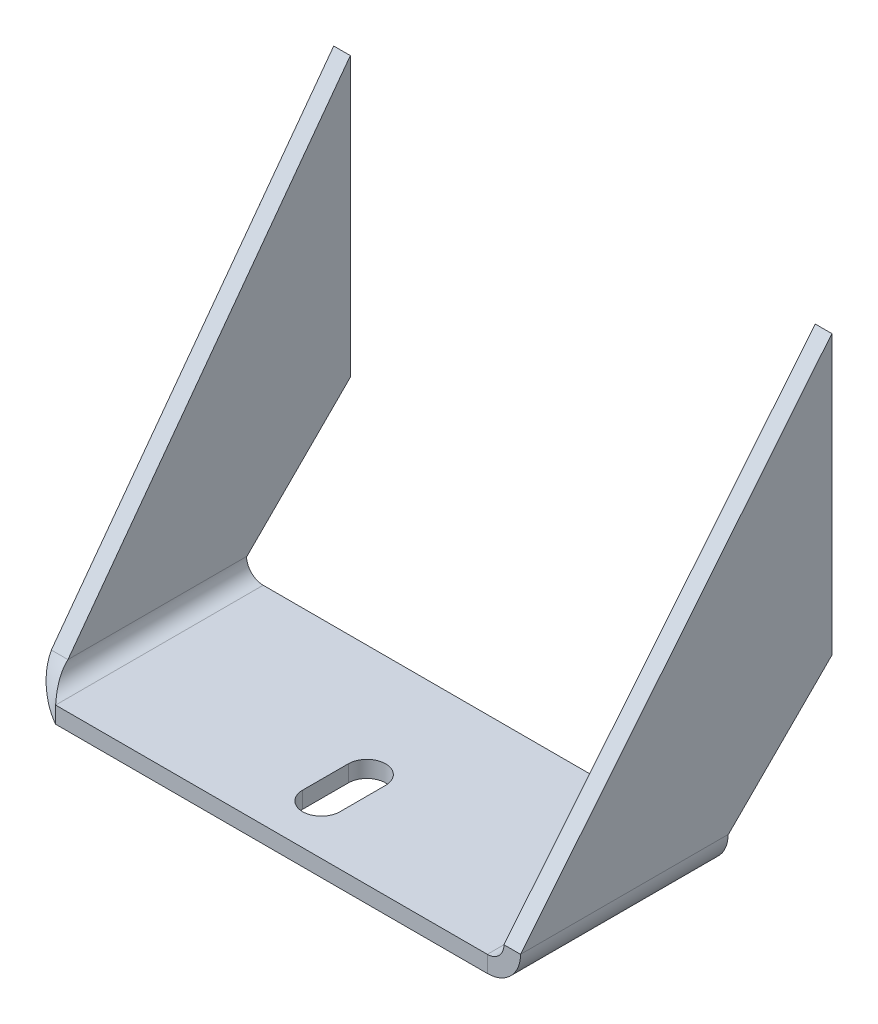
ISO-10303-21;
HEADER;
FILE_DESCRIPTION(('STEP AP214'),'2;1');
FILE_NAME('part.step','',(''),(''),'','','');
FILE_SCHEMA(('AUTOMOTIVE_DESIGN { 1 0 10303 214 1 1 1 1 }'));
ENDSEC;
DATA;
#1=APPLICATION_CONTEXT('core data for automotive mechanical design processes');
#2=APPLICATION_PROTOCOL_DEFINITION('international standard','automotive_design',2000,#1);
#3=PRODUCT_CONTEXT('',#1,'mechanical');
#4=PRODUCT('Part','Part','',(#3));
#5=PRODUCT_RELATED_PRODUCT_CATEGORY('part','',(#4));
#6=PRODUCT_DEFINITION_FORMATION('','',#4);
#7=PRODUCT_DEFINITION_CONTEXT('part definition',#1,'design');
#8=PRODUCT_DEFINITION('design','',#6,#7);
#9=PRODUCT_DEFINITION_SHAPE('','',#8);
#10=(LENGTH_UNIT() NAMED_UNIT(*) SI_UNIT(.MILLI.,.METRE.));
#11=(NAMED_UNIT(*) PLANE_ANGLE_UNIT() SI_UNIT($,.RADIAN.));
#12=(NAMED_UNIT(*) SI_UNIT($,.STERADIAN.) SOLID_ANGLE_UNIT());
#13=UNCERTAINTY_MEASURE_WITH_UNIT(LENGTH_MEASURE(1.E-05),#10,'distance_accuracy_value','');
#14=(GEOMETRIC_REPRESENTATION_CONTEXT(3) GLOBAL_UNCERTAINTY_ASSIGNED_CONTEXT((#13)) GLOBAL_UNIT_ASSIGNED_CONTEXT((#10,
#11,#12)) REPRESENTATION_CONTEXT('',''));
#15=CARTESIAN_POINT('',(0.,0.,0.));
#16=DIRECTION('',(0.,0.,1.));
#17=DIRECTION('',(1.,0.,0.));
#18=AXIS2_PLACEMENT_3D('',#15,#16,#17);
#19=CARTESIAN_POINT('',(56.,8.00000000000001,75.));
#20=DIRECTION('',(0.,0.,1.));
#21=DIRECTION('',(1.,0.,0.));
#22=AXIS2_PLACEMENT_3D('',#19,#20,#21);
#23=PLANE('',#22);
#24=DIRECTION('',(-1.,0.,0.));
#25=VECTOR('',#24,1.);
#26=CARTESIAN_POINT('',(-60.,0.,75.));
#27=LINE('',#26,#25);
#28=CARTESIAN_POINT('',(52.,0.,75.));
#29=VERTEX_POINT('',#28);
#30=CARTESIAN_POINT('',(-52.,0.,75.));
#31=VERTEX_POINT('',#30);
#32=EDGE_CURVE('E387',#29,#31,#27,.T.);
#33=ORIENTED_EDGE('',*,*,#32,.F.);
#34=DIRECTION('',(0.,1.,0.));
#35=VECTOR('',#34,1.);
#36=CARTESIAN_POINT('',(52.,0.,75.));
#37=LINE('',#36,#35);
#38=CARTESIAN_POINT('',(52.,4.,75.));
#39=VERTEX_POINT('',#38);
#40=EDGE_CURVE('E375',#29,#39,#37,.T.);
#41=ORIENTED_EDGE('',*,*,#40,.T.);
#42=DIRECTION('',(1.,0.,0.));
#43=VECTOR('',#42,1.);
#44=CARTESIAN_POINT('',(-60.,4.,75.));
#45=LINE('',#44,#43);
#46=CARTESIAN_POINT('',(-52.,4.,75.));
#47=VERTEX_POINT('',#46);
#48=EDGE_CURVE('E370',#39,#47,#45,.F.);
#49=ORIENTED_EDGE('',*,*,#48,.T.);
#50=CARTESIAN_POINT('',(-52.,0.,75.));
#51=CARTESIAN_POINT('',(-52.,4.,75.));
#52=B_SPLINE_CURVE_WITH_KNOTS('',1,(#50,#51),.UNSPECIFIED.,.F.,.F.,(2,2),(0.,1.),.UNSPECIFIED.);
#53=EDGE_CURVE('E299',#47,#31,#52,.F.);
#54=ORIENTED_EDGE('',*,*,#53,.T.);
#55=EDGE_LOOP('',(#33,#41,#49,#54));
#56=FACE_BOUND('',#55,.T.);
#57=ADVANCED_FACE('F47',(#56),#23,.T.);
#58=CARTESIAN_POINT('',(-60.,0.,75.));
#59=DIRECTION('',(0.,-1.,0.));
#60=DIRECTION('',(0.,0.,-1.));
#61=AXIS2_PLACEMENT_3D('',#58,#59,#60);
#62=PLANE('',#61);
#63=CARTESIAN_POINT('',(0.,0.,52.));
#64=DIRECTION('',(0.,1.,0.));
#65=DIRECTION('',(0.,0.,-1.));
#66=AXIS2_PLACEMENT_3D('',#63,#64,#65);
#67=CIRCLE('',#66,4.5);
#68=CARTESIAN_POINT('',(4.5,0.,52.));
#69=VERTEX_POINT('',#68);
#70=CARTESIAN_POINT('',(-4.5,0.,52.));
#71=VERTEX_POINT('',#70);
#72=EDGE_CURVE('E174',#69,#71,#67,.T.);
#73=ORIENTED_EDGE('',*,*,#72,.T.);
#74=DIRECTION('',(0.,0.,1.));
#75=VECTOR('',#74,1.);
#76=CARTESIAN_POINT('',(-4.5,0.,52.));
#77=LINE('',#76,#75);
#78=CARTESIAN_POINT('',(-4.5,0.,63.));
#79=VERTEX_POINT('',#78);
#80=EDGE_CURVE('E183',#71,#79,#77,.T.);
#81=ORIENTED_EDGE('',*,*,#80,.T.);
#82=CARTESIAN_POINT('',(0.,0.,63.));
#83=DIRECTION('',(0.,1.,0.));
#84=DIRECTION('',(0.,0.,1.));
#85=AXIS2_PLACEMENT_3D('',#82,#83,#84);
#86=CIRCLE('',#85,4.5);
#87=CARTESIAN_POINT('',(4.5,0.,63.));
#88=VERTEX_POINT('',#87);
#89=EDGE_CURVE('E61',#79,#88,#86,.T.);
#90=ORIENTED_EDGE('',*,*,#89,.T.);
#91=DIRECTION('',(0.,0.,-1.));
#92=VECTOR('',#91,1.);
#93=CARTESIAN_POINT('',(4.5,0.,52.));
#94=LINE('',#93,#92);
#95=EDGE_CURVE('E181',#88,#69,#94,.T.);
#96=ORIENTED_EDGE('',*,*,#95,.T.);
#97=EDGE_LOOP('',(#73,#81,#90,#96));
#98=FACE_BOUND('',#97,.T.);
#99=DIRECTION('',(1.,0.,0.));
#100=VECTOR('',#99,1.);
#101=CARTESIAN_POINT('',(-61.4247779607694,0.,25.));
#102=LINE('',#101,#100);
#103=CARTESIAN_POINT('',(-52.,0.,25.));
#104=VERTEX_POINT('',#103);
#105=CARTESIAN_POINT('',(52.,0.,25.));
#106=VERTEX_POINT('',#105);
#107=EDGE_CURVE('E384',#104,#106,#102,.T.);
#108=ORIENTED_EDGE('',*,*,#107,.T.);
#109=DIRECTION('',(0.,0.,-1.));
#110=VECTOR('',#109,1.);
#111=CARTESIAN_POINT('',(52.,0.,75.));
#112=LINE('',#111,#110);
#113=EDGE_CURVE('E361',#29,#106,#112,.T.);
#114=ORIENTED_EDGE('',*,*,#113,.F.);
#115=ORIENTED_EDGE('',*,*,#32,.T.);
#116=DIRECTION('',(0.,0.,-1.));
#117=VECTOR('',#116,1.);
#118=CARTESIAN_POINT('',(-52.,0.,75.));
#119=LINE('',#118,#117);
#120=EDGE_CURVE('E374',#31,#104,#119,.T.);
#121=ORIENTED_EDGE('',*,*,#120,.T.);
#122=EDGE_LOOP('',(#108,#114,#115,#121));
#123=FACE_BOUND('',#122,.T.);
#124=ADVANCED_FACE('F189',(#98,#123),#62,.T.);
#125=CARTESIAN_POINT('',(-60.,4.,75.));
#126=DIRECTION('',(0.,-1.,0.));
#127=DIRECTION('',(0.,0.,-1.));
#128=AXIS2_PLACEMENT_3D('',#125,#126,#127);
#129=PLANE('',#128);
#130=DIRECTION('',(0.,0.,1.));
#131=VECTOR('',#130,1.);
#132=CARTESIAN_POINT('',(-4.5,4.,52.));
#133=LINE('',#132,#131);
#134=CARTESIAN_POINT('',(-4.5,4.,52.));
#135=VERTEX_POINT('',#134);
#136=CARTESIAN_POINT('',(-4.5,4.,63.));
#137=VERTEX_POINT('',#136);
#138=EDGE_CURVE('E197',#135,#137,#133,.T.);
#139=ORIENTED_EDGE('',*,*,#138,.F.);
#140=CARTESIAN_POINT('',(0.,4.,52.));
#141=DIRECTION('',(0.,1.,0.));
#142=DIRECTION('',(0.,0.,-1.));
#143=AXIS2_PLACEMENT_3D('',#140,#141,#142);
#144=CIRCLE('',#143,4.5);
#145=CARTESIAN_POINT('',(4.5,4.,52.));
#146=VERTEX_POINT('',#145);
#147=EDGE_CURVE('E75',#146,#135,#144,.T.);
#148=ORIENTED_EDGE('',*,*,#147,.F.);
#149=DIRECTION('',(0.,0.,-1.));
#150=VECTOR('',#149,1.);
#151=CARTESIAN_POINT('',(4.5,4.,52.));
#152=LINE('',#151,#150);
#153=CARTESIAN_POINT('',(4.5,4.,63.));
#154=VERTEX_POINT('',#153);
#155=EDGE_CURVE('E192',#154,#146,#152,.T.);
#156=ORIENTED_EDGE('',*,*,#155,.F.);
#157=CARTESIAN_POINT('',(0.,4.,63.));
#158=DIRECTION('',(0.,1.,0.));
#159=DIRECTION('',(0.,0.,1.));
#160=AXIS2_PLACEMENT_3D('',#157,#158,#159);
#161=CIRCLE('',#160,4.5);
#162=EDGE_CURVE('E191',#137,#154,#161,.T.);
#163=ORIENTED_EDGE('',*,*,#162,.F.);
#164=EDGE_LOOP('',(#139,#148,#156,#163));
#165=FACE_BOUND('',#164,.T.);
#166=DIRECTION('',(0.,0.,-1.));
#167=VECTOR('',#166,1.);
#168=CARTESIAN_POINT('',(52.,4.,75.));
#169=LINE('',#168,#167);
#170=CARTESIAN_POINT('',(52.,4.,25.));
#171=VERTEX_POINT('',#170);
#172=EDGE_CURVE('E367',#39,#171,#169,.T.);
#173=ORIENTED_EDGE('',*,*,#172,.T.);
#174=DIRECTION('',(1.,0.,0.));
#175=VECTOR('',#174,1.);
#176=CARTESIAN_POINT('',(-61.4247779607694,4.,25.));
#177=LINE('',#176,#175);
#178=CARTESIAN_POINT('',(-52.,4.,25.));
#179=VERTEX_POINT('',#178);
#180=EDGE_CURVE('E356',#179,#171,#177,.T.);
#181=ORIENTED_EDGE('',*,*,#180,.F.);
#182=DIRECTION('',(0.,0.,-1.));
#183=VECTOR('',#182,1.);
#184=CARTESIAN_POINT('',(-52.,4.,75.));
#185=LINE('',#184,#183);
#186=EDGE_CURVE('E379',#47,#179,#185,.T.);
#187=ORIENTED_EDGE('',*,*,#186,.F.);
#188=ORIENTED_EDGE('',*,*,#48,.F.);
#189=EDGE_LOOP('',(#173,#181,#187,#188));
#190=FACE_BOUND('',#189,.T.);
#191=ADVANCED_FACE('F416',(#165,#190),#129,.F.);
#192=CARTESIAN_POINT('',(-61.4247779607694,0.,25.));
#193=DIRECTION('',(0.,0.,1.));
#194=DIRECTION('',(1.,0.,0.));
#195=AXIS2_PLACEMENT_3D('',#192,#193,#194);
#196=PLANE('',#195);
#197=DIRECTION('',(0.,-1.,0.));
#198=VECTOR('',#197,1.);
#199=CARTESIAN_POINT('',(-52.,4.,25.));
#200=LINE('',#199,#198);
#201=EDGE_CURVE('E376',#179,#104,#200,.T.);
#202=ORIENTED_EDGE('',*,*,#201,.F.);
#203=ORIENTED_EDGE('',*,*,#180,.T.);
#204=DIRECTION('',(0.,1.,0.));
#205=VECTOR('',#204,1.);
#206=CARTESIAN_POINT('',(52.,0.,25.));
#207=LINE('',#206,#205);
#208=EDGE_CURVE('E366',#106,#171,#207,.T.);
#209=ORIENTED_EDGE('',*,*,#208,.F.);
#210=ORIENTED_EDGE('',*,*,#107,.F.);
#211=EDGE_LOOP('',(#202,#203,#209,#210));
#212=FACE_BOUND('',#211,.T.);
#213=ADVANCED_FACE('F412',(#212),#196,.F.);
#214=CARTESIAN_POINT('',(52.,8.,25.));
#215=DIRECTION('',(0.,0.,-1.));
#216=DIRECTION('',(-1.,0.,0.));
#217=AXIS2_PLACEMENT_3D('',#214,#215,#216);
#218=PLANE('',#217);
#219=ORIENTED_EDGE('',*,*,#208,.T.);
#220=CARTESIAN_POINT('',(52.,8.,25.));
#221=DIRECTION('',(0.,0.,1.));
#222=DIRECTION('',(1.,0.,0.));
#223=AXIS2_PLACEMENT_3D('',#220,#221,#222);
#224=CIRCLE('',#223,4.);
#225=CARTESIAN_POINT('',(56.,8.00000000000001,25.));
#226=VERTEX_POINT('',#225);
#227=EDGE_CURVE('E322',#171,#226,#224,.T.);
#228=ORIENTED_EDGE('',*,*,#227,.T.);
#229=DIRECTION('',(-1.,0.,0.));
#230=VECTOR('',#229,1.);
#231=CARTESIAN_POINT('',(60.,8.00000000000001,25.));
#232=LINE('',#231,#230);
#233=CARTESIAN_POINT('',(60.,8.00000000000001,25.));
#234=VERTEX_POINT('',#233);
#235=EDGE_CURVE('E327',#234,#226,#232,.T.);
#236=ORIENTED_EDGE('',*,*,#235,.F.);
#237=CARTESIAN_POINT('',(52.,8.,25.));
#238=DIRECTION('',(0.,0.,1.));
#239=DIRECTION('',(1.,0.,0.));
#240=AXIS2_PLACEMENT_3D('',#237,#238,#239);
#241=CIRCLE('',#240,8.);
#242=EDGE_CURVE('E351',#106,#234,#241,.T.);
#243=ORIENTED_EDGE('',*,*,#242,.F.);
#244=EDGE_LOOP('',(#219,#228,#236,#243));
#245=FACE_BOUND('',#244,.T.);
#246=ADVANCED_FACE('F411',(#245),#218,.T.);
#247=CARTESIAN_POINT('',(52.,8.,75.));
#248=DIRECTION('',(0.,0.,1.));
#249=DIRECTION('',(1.,0.,0.));
#250=AXIS2_PLACEMENT_3D('',#247,#248,#249);
#251=PLANE('',#250);
#252=DIRECTION('',(1.,0.,0.));
#253=VECTOR('',#252,1.);
#254=CARTESIAN_POINT('',(56.,8.00000000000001,75.));
#255=LINE('',#254,#253);
#256=CARTESIAN_POINT('',(56.,8.00000000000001,75.));
#257=VERTEX_POINT('',#256);
#258=CARTESIAN_POINT('',(60.,7.99999999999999,75.));
#259=VERTEX_POINT('',#258);
#260=EDGE_CURVE('E325',#257,#259,#255,.T.);
#261=ORIENTED_EDGE('',*,*,#260,.F.);
#262=CARTESIAN_POINT('',(52.,8.,75.));
#263=DIRECTION('',(0.,0.,1.));
#264=DIRECTION('',(1.,0.,0.));
#265=AXIS2_PLACEMENT_3D('',#262,#263,#264);
#266=CIRCLE('',#265,4.);
#267=EDGE_CURVE('E355',#257,#39,#266,.F.);
#268=ORIENTED_EDGE('',*,*,#267,.T.);
#269=ORIENTED_EDGE('',*,*,#40,.F.);
#270=CARTESIAN_POINT('',(52.,8.,75.));
#271=DIRECTION('',(0.,0.,-1.));
#272=DIRECTION('',(-1.,0.,0.));
#273=AXIS2_PLACEMENT_3D('',#270,#271,#272);
#274=CIRCLE('',#273,8.);
#275=EDGE_CURVE('E353',#259,#29,#274,.T.);
#276=ORIENTED_EDGE('',*,*,#275,.F.);
#277=EDGE_LOOP('',(#261,#268,#269,#276));
#278=FACE_BOUND('',#277,.T.);
#279=ADVANCED_FACE('F637',(#278),#251,.T.);
#280=CARTESIAN_POINT('',(52.,8.,-1.03750032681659));
#281=DIRECTION('',(0.,0.,1.));
#282=DIRECTION('',(1.,0.,0.));
#283=AXIS2_PLACEMENT_3D('',#280,#281,#282);
#284=CYLINDRICAL_SURFACE('',#283,8.);
#285=ORIENTED_EDGE('',*,*,#275,.T.);
#286=ORIENTED_EDGE('',*,*,#113,.T.);
#287=ORIENTED_EDGE('',*,*,#242,.T.);
#288=DIRECTION('',(0.,0.,-1.));
#289=VECTOR('',#288,1.);
#290=CARTESIAN_POINT('',(60.,8.00000000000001,75.));
#291=LINE('',#290,#289);
#292=EDGE_CURVE('E339',#259,#234,#291,.T.);
#293=ORIENTED_EDGE('',*,*,#292,.F.);
#294=EDGE_LOOP('',(#285,#286,#287,#293));
#295=FACE_BOUND('',#294,.T.);
#296=ADVANCED_FACE('F631',(#295),#284,.T.);
#297=CARTESIAN_POINT('',(52.,8.,-1.03750032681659));
#298=DIRECTION('',(0.,0.,1.));
#299=DIRECTION('',(1.,0.,0.));
#300=AXIS2_PLACEMENT_3D('',#297,#298,#299);
#301=CYLINDRICAL_SURFACE('',#300,4.);
#302=ORIENTED_EDGE('',*,*,#267,.F.);
#303=DIRECTION('',(0.,0.,-1.));
#304=VECTOR('',#303,1.);
#305=CARTESIAN_POINT('',(56.,8.00000000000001,75.));
#306=LINE('',#305,#304);
#307=EDGE_CURVE('E347',#257,#226,#306,.T.);
#308=ORIENTED_EDGE('',*,*,#307,.T.);
#309=ORIENTED_EDGE('',*,*,#227,.F.);
#310=ORIENTED_EDGE('',*,*,#172,.F.);
#311=EDGE_LOOP('',(#302,#308,#309,#310));
#312=FACE_BOUND('',#311,.T.);
#313=ADVANCED_FACE('F595',(#312),#301,.F.);
#314=CARTESIAN_POINT('',(52.,4.,0.));
#315=DIRECTION('',(0.,0.,-1.));
#316=DIRECTION('',(-1.,0.,0.));
#317=AXIS2_PLACEMENT_3D('',#314,#315,#316);
#318=PLANE('',#317);
#319=DIRECTION('',(0.,-1.,0.));
#320=VECTOR('',#319,1.);
#321=CARTESIAN_POINT('',(60.,100.,0.));
#322=LINE('',#321,#320);
#323=CARTESIAN_POINT('',(60.,100.,0.));
#324=VERTEX_POINT('',#323);
#325=CARTESIAN_POINT('',(60.,32.9,0.));
#326=VERTEX_POINT('',#325);
#327=EDGE_CURVE('E343',#324,#326,#322,.T.);
#328=ORIENTED_EDGE('',*,*,#327,.T.);
#329=DIRECTION('',(-1.,0.,0.));
#330=VECTOR('',#329,1.);
#331=CARTESIAN_POINT('',(56.,32.9,0.));
#332=LINE('',#331,#330);
#333=CARTESIAN_POINT('',(56.,32.9,0.));
#334=VERTEX_POINT('',#333);
#335=EDGE_CURVE('E378',#326,#334,#332,.T.);
#336=ORIENTED_EDGE('',*,*,#335,.T.);
#337=DIRECTION('',(0.,-1.,0.));
#338=VECTOR('',#337,1.);
#339=CARTESIAN_POINT('',(56.,100.,0.));
#340=LINE('',#339,#338);
#341=CARTESIAN_POINT('',(56.,100.,0.));
#342=VERTEX_POINT('',#341);
#343=EDGE_CURVE('E321',#342,#334,#340,.T.);
#344=ORIENTED_EDGE('',*,*,#343,.F.);
#345=DIRECTION('',(1.,0.,0.));
#346=VECTOR('',#345,1.);
#347=CARTESIAN_POINT('',(56.,100.,0.));
#348=LINE('',#347,#346);
#349=EDGE_CURVE('E345',#342,#324,#348,.T.);
#350=ORIENTED_EDGE('',*,*,#349,.T.);
#351=EDGE_LOOP('',(#328,#336,#344,#350));
#352=FACE_BOUND('',#351,.T.);
#353=ADVANCED_FACE('F588',(#352),#318,.T.);
#354=CARTESIAN_POINT('',(60.,100.,75.));
#355=DIRECTION('',(1.,0.,0.));
#356=DIRECTION('',(0.,1.,0.));
#357=AXIS2_PLACEMENT_3D('',#354,#355,#356);
#358=PLANE('',#357);
#359=DIRECTION('',(0.,0.,-1.));
#360=VECTOR('',#359,1.);
#361=CARTESIAN_POINT('',(60.,8.00000000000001,0.));
#362=LINE('',#361,#360);
#363=CARTESIAN_POINT('',(60.,8.00000000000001,24.9));
#364=VERTEX_POINT('',#363);
#365=EDGE_CURVE('E337',#234,#364,#362,.T.);
#366=ORIENTED_EDGE('',*,*,#365,.T.);
#367=DIRECTION('',(0.,0.707106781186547,-0.707106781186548));
#368=VECTOR('',#367,1.);
#369=CARTESIAN_POINT('',(60.,28.95,3.95000000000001));
#370=LINE('',#369,#368);
#371=EDGE_CURVE('E431',#364,#326,#370,.T.);
#372=ORIENTED_EDGE('',*,*,#371,.T.);
#373=ORIENTED_EDGE('',*,*,#327,.F.);
#374=DIRECTION('',(0.,0.775082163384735,-0.631860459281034));
#375=VECTOR('',#374,1.);
#376=CARTESIAN_POINT('',(60.,63.2692171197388,29.9435730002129));
#377=LINE('',#376,#375);
#378=EDGE_CURVE('E313',#259,#324,#377,.T.);
#379=ORIENTED_EDGE('',*,*,#378,.F.);
#380=ORIENTED_EDGE('',*,*,#292,.T.);
#381=EDGE_LOOP('',(#366,#372,#373,#379,#380));
#382=FACE_BOUND('',#381,.T.);
#383=ADVANCED_FACE('F580',(#382),#358,.T.);
#384=CARTESIAN_POINT('',(60.,8.00000000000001,0.));
#385=DIRECTION('',(0.,1.,0.));
#386=DIRECTION('',(0.,0.,-1.));
#387=AXIS2_PLACEMENT_3D('',#384,#385,#386);
#388=PLANE('',#387);
#389=DIRECTION('',(0.,0.,-1.));
#390=VECTOR('',#389,1.);
#391=CARTESIAN_POINT('',(56.,8.00000000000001,0.));
#392=LINE('',#391,#390);
#393=CARTESIAN_POINT('',(56.,8.00000000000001,24.9));
#394=VERTEX_POINT('',#393);
#395=EDGE_CURVE('E333',#226,#394,#392,.T.);
#396=ORIENTED_EDGE('',*,*,#395,.T.);
#397=DIRECTION('',(1.,0.,0.));
#398=VECTOR('',#397,1.);
#399=CARTESIAN_POINT('',(60.,8.00000000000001,24.9));
#400=LINE('',#399,#398);
#401=EDGE_CURVE('E435',#394,#364,#400,.T.);
#402=ORIENTED_EDGE('',*,*,#401,.T.);
#403=ORIENTED_EDGE('',*,*,#365,.F.);
#404=ORIENTED_EDGE('',*,*,#235,.T.);
#405=EDGE_LOOP('',(#396,#402,#403,#404));
#406=FACE_BOUND('',#405,.T.);
#407=ADVANCED_FACE('F570',(#406),#388,.F.);
#408=CARTESIAN_POINT('',(56.,100.,75.));
#409=DIRECTION('',(1.,0.,0.));
#410=DIRECTION('',(0.,1.,0.));
#411=AXIS2_PLACEMENT_3D('',#408,#409,#410);
#412=PLANE('',#411);
#413=ORIENTED_EDGE('',*,*,#343,.T.);
#414=DIRECTION('',(0.,-0.707106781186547,0.707106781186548));
#415=VECTOR('',#414,1.);
#416=CARTESIAN_POINT('',(56.,32.9,0.));
#417=LINE('',#416,#415);
#418=EDGE_CURVE('E441',#334,#394,#417,.T.);
#419=ORIENTED_EDGE('',*,*,#418,.T.);
#420=ORIENTED_EDGE('',*,*,#395,.F.);
#421=ORIENTED_EDGE('',*,*,#307,.F.);
#422=DIRECTION('',(0.,0.775082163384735,-0.631860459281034));
#423=VECTOR('',#422,1.);
#424=CARTESIAN_POINT('',(56.,63.2692171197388,29.9435730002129));
#425=LINE('',#424,#423);
#426=EDGE_CURVE('E330',#257,#342,#425,.T.);
#427=ORIENTED_EDGE('',*,*,#426,.T.);
#428=EDGE_LOOP('',(#413,#419,#420,#421,#427));
#429=FACE_BOUND('',#428,.T.);
#430=ADVANCED_FACE('F565',(#429),#412,.F.);
#431=CARTESIAN_POINT('',(56.,63.2692171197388,29.9435730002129));
#432=DIRECTION('',(0.,-0.631860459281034,-0.775082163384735));
#433=DIRECTION('',(0.,0.775082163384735,-0.631860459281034));
#434=AXIS2_PLACEMENT_3D('',#431,#432,#433);
#435=PLANE('',#434);
#436=ORIENTED_EDGE('',*,*,#349,.F.);
#437=ORIENTED_EDGE('',*,*,#426,.F.);
#438=ORIENTED_EDGE('',*,*,#260,.T.);
#439=ORIENTED_EDGE('',*,*,#378,.T.);
#440=EDGE_LOOP('',(#436,#437,#438,#439));
#441=FACE_BOUND('',#440,.T.);
#442=ADVANCED_FACE('F566',(#441),#435,.F.);
#443=CARTESIAN_POINT('',(-52.,8.,25.));
#444=DIRECTION('',(0.,0.,-1.));
#445=DIRECTION('',(-1.,0.,0.));
#446=AXIS2_PLACEMENT_3D('',#443,#444,#445);
#447=PLANE('',#446);
#448=DIRECTION('',(1.,0.,0.));
#449=VECTOR('',#448,1.);
#450=CARTESIAN_POINT('',(-60.,8.,25.));
#451=LINE('',#450,#449);
#452=CARTESIAN_POINT('',(-60.,8.,25.));
#453=VERTEX_POINT('',#452);
#454=CARTESIAN_POINT('',(-56.,8.,25.));
#455=VERTEX_POINT('',#454);
#456=EDGE_CURVE('E223',#453,#455,#451,.T.);
#457=ORIENTED_EDGE('',*,*,#456,.T.);
#458=CARTESIAN_POINT('',(-52.,8.,25.));
#459=DIRECTION('',(0.,0.,-1.));
#460=DIRECTION('',(-1.,0.,0.));
#461=AXIS2_PLACEMENT_3D('',#458,#459,#460);
#462=CIRCLE('',#461,4.);
#463=EDGE_CURVE('E215',#455,#179,#462,.F.);
#464=ORIENTED_EDGE('',*,*,#463,.T.);
#465=ORIENTED_EDGE('',*,*,#201,.T.);
#466=CARTESIAN_POINT('',(-52.,8.,25.));
#467=DIRECTION('',(0.,0.,1.));
#468=DIRECTION('',(1.,0.,0.));
#469=AXIS2_PLACEMENT_3D('',#466,#467,#468);
#470=CIRCLE('',#469,8.);
#471=EDGE_CURVE('E227',#453,#104,#470,.T.);
#472=ORIENTED_EDGE('',*,*,#471,.F.);
#473=EDGE_LOOP('',(#457,#464,#465,#472));
#474=FACE_BOUND('',#473,.T.);
#475=ADVANCED_FACE('F612',(#474),#447,.T.);
#476=CARTESIAN_POINT('',(-52.,0.,75.));
#477=CARTESIAN_POINT('',(-53.0473419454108,0.,74.4191460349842));
#478=CARTESIAN_POINT('',(-54.0939830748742,0.208218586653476,73.838452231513));
#479=CARTESIAN_POINT('',(-56.0289518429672,1.00970889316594,72.6769044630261));
#480=CARTESIAN_POINT('',(-56.9163737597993,1.60266526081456,72.0961305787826));
#481=CARTESIAN_POINT('',(-58.3973347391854,3.08362624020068,70.9345828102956));
#482=CARTESIAN_POINT('',(-58.9902911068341,3.9710481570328,70.3538089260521));
#483=CARTESIAN_POINT('',(-59.7917814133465,5.90601692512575,69.1922611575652));
#484=CARTESIAN_POINT('',(-60.,6.95265805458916,68.611567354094));
#485=CARTESIAN_POINT('',(-60.,8.,68.0307133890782));
#486=CARTESIAN_POINT('',(-52.,4.,75.));
#487=CARTESIAN_POINT('',(-52.5236411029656,4.,74.4191791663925));
#488=CARTESIAN_POINT('',(-53.0469915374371,4.10410929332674,73.838452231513));
#489=CARTESIAN_POINT('',(-54.0144759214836,4.50485444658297,72.6769044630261));
#490=CARTESIAN_POINT('',(-54.4581868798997,4.80133263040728,72.0961305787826));
#491=CARTESIAN_POINT('',(-55.1986673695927,5.54181312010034,70.9345828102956));
#492=CARTESIAN_POINT('',(-55.495145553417,5.9855240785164,70.3538089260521));
#493=CARTESIAN_POINT('',(-55.8958907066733,6.95300846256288,69.1922611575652));
#494=CARTESIAN_POINT('',(-56.,7.47635889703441,68.6115342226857));
#495=CARTESIAN_POINT('',(-56.,8.,68.0307133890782));
#496=B_SPLINE_SURFACE_WITH_KNOTS('',1,3,((#476,#477,#478,#479,#480,#481,#482,#483,#484,#485),
(#486,#487,#488,#489,#490,#491,#492,#493,#494,#495)),.UNSPECIFIED.,.F.,.F.,.F.,(2,2),(4,2,2,2,
4),(0.,1.),(0.,0.25,0.5,0.75,1.),.UNSPECIFIED.);
#497=CARTESIAN_POINT('',(-52.,4.,75.));
#498=CARTESIAN_POINT('',(-52.5236411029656,4.,74.4191791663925));
#499=CARTESIAN_POINT('',(-53.0469915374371,4.10410929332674,73.838452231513));
#500=CARTESIAN_POINT('',(-54.0144759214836,4.50485444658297,72.6769044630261));
#501=CARTESIAN_POINT('',(-54.4581868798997,4.80133263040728,72.0961305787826));
#502=CARTESIAN_POINT('',(-55.1986673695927,5.54181312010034,70.9345828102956));
#503=CARTESIAN_POINT('',(-55.495145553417,5.9855240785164,70.3538089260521));
#504=CARTESIAN_POINT('',(-55.8958907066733,6.95300846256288,69.1922611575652));
#505=CARTESIAN_POINT('',(-56.,7.47635889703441,68.6115342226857));
#506=CARTESIAN_POINT('',(-56.,8.,68.0307133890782));
#507=B_SPLINE_CURVE_WITH_KNOTS('',3,(#497,#498,#499,#500,#501,#502,#503,#504,#505,#506),
.UNSPECIFIED.,.F.,.F.,(4,2,2,2,4),(0.,0.25,0.5,0.75,1.),.UNSPECIFIED.);
#508=CARTESIAN_POINT('',(-56.,8.,68.0307133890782));
#509=VERTEX_POINT('',#508);
#510=EDGE_CURVE('E233',#47,#509,#507,.T.);
#511=CARTESIAN_POINT('',(-56.,8.,68.0307133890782));
#512=CARTESIAN_POINT('',(-60.,8.,68.0307133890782));
#513=B_SPLINE_CURVE_WITH_KNOTS('',1,(#511,#512),.UNSPECIFIED.,.F.,.F.,(2,2),(0.,1.),.UNSPECIFIED.);
#514=CARTESIAN_POINT('',(-60.,8.,68.0307133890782));
#515=VERTEX_POINT('',#514);
#516=EDGE_CURVE('E309',#515,#509,#513,.F.);
#517=CARTESIAN_POINT('',(-60.,8.,68.0307133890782));
#518=CARTESIAN_POINT('',(-60.,6.95265805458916,68.611567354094));
#519=CARTESIAN_POINT('',(-59.7917814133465,5.90601692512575,69.1922611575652));
#520=CARTESIAN_POINT('',(-58.9902911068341,3.9710481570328,70.3538089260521));
#521=CARTESIAN_POINT('',(-58.3973347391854,3.08362624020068,70.9345828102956));
#522=CARTESIAN_POINT('',(-56.9163737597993,1.60266526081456,72.0961305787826));
#523=CARTESIAN_POINT('',(-56.0289518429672,1.00970889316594,72.6769044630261));
#524=CARTESIAN_POINT('',(-54.0939830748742,0.208218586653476,73.838452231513));
#525=CARTESIAN_POINT('',(-53.0473419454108,0.,74.4191460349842));
#526=CARTESIAN_POINT('',(-52.,0.,75.));
#527=B_SPLINE_CURVE_WITH_KNOTS('',3,(#517,#518,#519,#520,#521,#522,#523,#524,#525,#526),
.UNSPECIFIED.,.F.,.F.,(4,2,2,2,4),(0.,0.25,0.5,0.75,1.),.UNSPECIFIED.);
#528=EDGE_CURVE('E229',#31,#515,#527,.F.);
#529=ORIENTED_EDGE('',*,*,#53,.F.);
#530=ORIENTED_EDGE('',*,*,#510,.T.);
#531=ORIENTED_EDGE('',*,*,#516,.F.);
#532=ORIENTED_EDGE('',*,*,#528,.F.);
#533=EDGE_LOOP('',(#529,#530,#531,#532));
#534=FACE_BOUND('',#533,.T.);
#535=ADVANCED_FACE('F247',(#534),#496,.T.);
#536=CARTESIAN_POINT('',(-52.,8.,101.037500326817));
#537=DIRECTION('',(0.,0.,-1.));
#538=DIRECTION('',(-1.,0.,0.));
#539=AXIS2_PLACEMENT_3D('',#536,#537,#538);
#540=CYLINDRICAL_SURFACE('',#539,8.);
#541=ORIENTED_EDGE('',*,*,#528,.T.);
#542=DIRECTION('',(0.,0.,-1.));
#543=VECTOR('',#542,1.);
#544=CARTESIAN_POINT('',(-60.,8.,75.));
#545=LINE('',#544,#543);
#546=EDGE_CURVE('E207',#515,#453,#545,.T.);
#547=ORIENTED_EDGE('',*,*,#546,.T.);
#548=ORIENTED_EDGE('',*,*,#471,.T.);
#549=ORIENTED_EDGE('',*,*,#120,.F.);
#550=EDGE_LOOP('',(#541,#547,#548,#549));
#551=FACE_BOUND('',#550,.T.);
#552=ADVANCED_FACE('F240',(#551),#540,.T.);
#553=CARTESIAN_POINT('',(-52.,8.,101.037500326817));
#554=DIRECTION('',(0.,0.,-1.));
#555=DIRECTION('',(-1.,0.,0.));
#556=AXIS2_PLACEMENT_3D('',#553,#554,#555);
#557=CYLINDRICAL_SURFACE('',#556,4.);
#558=ORIENTED_EDGE('',*,*,#510,.F.);
#559=ORIENTED_EDGE('',*,*,#186,.T.);
#560=ORIENTED_EDGE('',*,*,#463,.F.);
#561=DIRECTION('',(0.,0.,-1.));
#562=VECTOR('',#561,1.);
#563=CARTESIAN_POINT('',(-56.,8.,75.));
#564=LINE('',#563,#562);
#565=EDGE_CURVE('E213',#509,#455,#564,.T.);
#566=ORIENTED_EDGE('',*,*,#565,.F.);
#567=EDGE_LOOP('',(#558,#559,#560,#566));
#568=FACE_BOUND('',#567,.T.);
#569=ADVANCED_FACE('F250',(#568),#557,.F.);
#570=CARTESIAN_POINT('',(-52.,8.,0.));
#571=DIRECTION('',(0.,0.,-1.));
#572=DIRECTION('',(-1.,0.,0.));
#573=AXIS2_PLACEMENT_3D('',#570,#571,#572);
#574=PLANE('',#573);
#575=DIRECTION('',(0.,1.,0.));
#576=VECTOR('',#575,1.);
#577=CARTESIAN_POINT('',(-56.,100.,0.));
#578=LINE('',#577,#576);
#579=CARTESIAN_POINT('',(-56.,32.9,0.));
#580=VERTEX_POINT('',#579);
#581=CARTESIAN_POINT('',(-56.,100.,0.));
#582=VERTEX_POINT('',#581);
#583=EDGE_CURVE('E214',#580,#582,#578,.T.);
#584=ORIENTED_EDGE('',*,*,#583,.F.);
#585=DIRECTION('',(-1.,0.,0.));
#586=VECTOR('',#585,1.);
#587=CARTESIAN_POINT('',(-60.,32.9,0.));
#588=LINE('',#587,#586);
#589=CARTESIAN_POINT('',(-60.,32.9,0.));
#590=VERTEX_POINT('',#589);
#591=EDGE_CURVE('E436',#580,#590,#588,.T.);
#592=ORIENTED_EDGE('',*,*,#591,.T.);
#593=DIRECTION('',(0.,1.,0.));
#594=VECTOR('',#593,1.);
#595=CARTESIAN_POINT('',(-60.,100.,0.));
#596=LINE('',#595,#594);
#597=CARTESIAN_POINT('',(-60.,100.,0.));
#598=VERTEX_POINT('',#597);
#599=EDGE_CURVE('E222',#590,#598,#596,.T.);
#600=ORIENTED_EDGE('',*,*,#599,.T.);
#601=DIRECTION('',(1.,0.,0.));
#602=VECTOR('',#601,1.);
#603=CARTESIAN_POINT('',(-60.,100.,0.));
#604=LINE('',#603,#602);
#605=EDGE_CURVE('E220',#598,#582,#604,.T.);
#606=ORIENTED_EDGE('',*,*,#605,.T.);
#607=EDGE_LOOP('',(#584,#592,#600,#606));
#608=FACE_BOUND('',#607,.T.);
#609=ADVANCED_FACE('F253',(#608),#574,.T.);
#610=CARTESIAN_POINT('',(-60.,100.,75.));
#611=DIRECTION('',(-1.,0.,0.));
#612=DIRECTION('',(0.,-1.,0.));
#613=AXIS2_PLACEMENT_3D('',#610,#611,#612);
#614=PLANE('',#613);
#615=ORIENTED_EDGE('',*,*,#599,.F.);
#616=DIRECTION('',(0.,-0.707106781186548,0.707106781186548));
#617=VECTOR('',#616,1.);
#618=CARTESIAN_POINT('',(-60.,28.95,3.95000000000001));
#619=LINE('',#618,#617);
#620=CARTESIAN_POINT('',(-60.,8.,24.9));
#621=VERTEX_POINT('',#620);
#622=EDGE_CURVE('E437',#590,#621,#619,.T.);
#623=ORIENTED_EDGE('',*,*,#622,.T.);
#624=DIRECTION('',(0.,0.,1.));
#625=VECTOR('',#624,1.);
#626=CARTESIAN_POINT('',(-60.,8.,0.));
#627=LINE('',#626,#625);
#628=EDGE_CURVE('E218',#621,#453,#627,.T.);
#629=ORIENTED_EDGE('',*,*,#628,.T.);
#630=ORIENTED_EDGE('',*,*,#546,.F.);
#631=DIRECTION('',(0.,-0.804047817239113,0.594564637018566));
#632=VECTOR('',#631,1.);
#633=CARTESIAN_POINT('',(-60.,64.1456201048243,26.5130330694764));
#634=LINE('',#633,#632);
#635=EDGE_CURVE('E217',#598,#515,#634,.T.);
#636=ORIENTED_EDGE('',*,*,#635,.F.);
#637=EDGE_LOOP('',(#615,#623,#629,#630,#636));
#638=FACE_BOUND('',#637,.T.);
#639=ADVANCED_FACE('F459',(#638),#614,.T.);
#640=CARTESIAN_POINT('',(-60.,64.1456201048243,26.5130330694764));
#641=DIRECTION('',(0.,-0.594564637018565,-0.804047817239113));
#642=DIRECTION('',(0.,-0.804047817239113,0.594564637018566));
#643=AXIS2_PLACEMENT_3D('',#640,#641,#642);
#644=PLANE('',#643);
#645=ORIENTED_EDGE('',*,*,#635,.T.);
#646=ORIENTED_EDGE('',*,*,#516,.T.);
#647=DIRECTION('',(0.,-0.804047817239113,0.594564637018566));
#648=VECTOR('',#647,1.);
#649=CARTESIAN_POINT('',(-56.,64.1456201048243,26.5130330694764));
#650=LINE('',#649,#648);
#651=EDGE_CURVE('E462',#582,#509,#650,.T.);
#652=ORIENTED_EDGE('',*,*,#651,.F.);
#653=ORIENTED_EDGE('',*,*,#605,.F.);
#654=EDGE_LOOP('',(#645,#646,#652,#653));
#655=FACE_BOUND('',#654,.T.);
#656=ADVANCED_FACE('F477',(#655),#644,.F.);
#657=CARTESIAN_POINT('',(-56.,100.,75.));
#658=DIRECTION('',(-1.,0.,0.));
#659=DIRECTION('',(0.,-1.,0.));
#660=AXIS2_PLACEMENT_3D('',#657,#658,#659);
#661=PLANE('',#660);
#662=DIRECTION('',(0.,0.,1.));
#663=VECTOR('',#662,1.);
#664=CARTESIAN_POINT('',(-56.,8.,0.));
#665=LINE('',#664,#663);
#666=CARTESIAN_POINT('',(-56.,8.,24.9));
#667=VERTEX_POINT('',#666);
#668=EDGE_CURVE('E208',#667,#455,#665,.T.);
#669=ORIENTED_EDGE('',*,*,#668,.F.);
#670=DIRECTION('',(0.,0.707106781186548,-0.707106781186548));
#671=VECTOR('',#670,1.);
#672=CARTESIAN_POINT('',(-56.,32.9,0.));
#673=LINE('',#672,#671);
#674=EDGE_CURVE('E12',#667,#580,#673,.T.);
#675=ORIENTED_EDGE('',*,*,#674,.T.);
#676=ORIENTED_EDGE('',*,*,#583,.T.);
#677=ORIENTED_EDGE('',*,*,#651,.T.);
#678=ORIENTED_EDGE('',*,*,#565,.T.);
#679=EDGE_LOOP('',(#669,#675,#676,#677,#678));
#680=FACE_BOUND('',#679,.T.);
#681=ADVANCED_FACE('F428',(#680),#661,.F.);
#682=CARTESIAN_POINT('',(-60.,8.,0.));
#683=DIRECTION('',(0.,1.,0.));
#684=DIRECTION('',(0.,0.,1.));
#685=AXIS2_PLACEMENT_3D('',#682,#683,#684);
#686=PLANE('',#685);
#687=ORIENTED_EDGE('',*,*,#628,.F.);
#688=DIRECTION('',(1.,0.,0.));
#689=VECTOR('',#688,1.);
#690=CARTESIAN_POINT('',(-56.,8.,24.9));
#691=LINE('',#690,#689);
#692=EDGE_CURVE('E60',#621,#667,#691,.T.);
#693=ORIENTED_EDGE('',*,*,#692,.T.);
#694=ORIENTED_EDGE('',*,*,#668,.T.);
#695=ORIENTED_EDGE('',*,*,#456,.F.);
#696=EDGE_LOOP('',(#687,#693,#694,#695));
#697=FACE_BOUND('',#696,.T.);
#698=ADVANCED_FACE('F249',(#697),#686,.F.);
#699=CARTESIAN_POINT('',(52.,32.9,0.));
#700=DIRECTION('',(0.,-0.707106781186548,-0.707106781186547));
#701=DIRECTION('',(0.,0.707106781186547,-0.707106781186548));
#702=AXIS2_PLACEMENT_3D('',#699,#700,#701);
#703=PLANE('',#702);
#704=ORIENTED_EDGE('',*,*,#371,.F.);
#705=ORIENTED_EDGE('',*,*,#401,.F.);
#706=ORIENTED_EDGE('',*,*,#418,.F.);
#707=ORIENTED_EDGE('',*,*,#335,.F.);
#708=EDGE_LOOP('',(#704,#705,#706,#707));
#709=FACE_BOUND('',#708,.T.);
#710=ADVANCED_FACE('F419',(#709),#703,.T.);
#711=CARTESIAN_POINT('',(-52.,32.9,0.));
#712=DIRECTION('',(0.,-0.707106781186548,-0.707106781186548));
#713=DIRECTION('',(0.,0.707106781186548,-0.707106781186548));
#714=AXIS2_PLACEMENT_3D('',#711,#712,#713);
#715=PLANE('',#714);
#716=ORIENTED_EDGE('',*,*,#674,.F.);
#717=ORIENTED_EDGE('',*,*,#692,.F.);
#718=ORIENTED_EDGE('',*,*,#622,.F.);
#719=ORIENTED_EDGE('',*,*,#591,.F.);
#720=EDGE_LOOP('',(#716,#717,#718,#719));
#721=FACE_BOUND('',#720,.T.);
#722=ADVANCED_FACE('F51',(#721),#715,.T.);
#723=CARTESIAN_POINT('',(0.,0.,52.));
#724=DIRECTION('',(0.,1.,0.));
#725=DIRECTION('',(0.,0.,1.));
#726=AXIS2_PLACEMENT_3D('',#723,#724,#725);
#727=CYLINDRICAL_SURFACE('',#726,4.5);
#728=ORIENTED_EDGE('',*,*,#147,.T.);
#729=DIRECTION('',(0.,1.,0.));
#730=VECTOR('',#729,1.);
#731=CARTESIAN_POINT('',(-4.5,0.,52.));
#732=LINE('',#731,#730);
#733=EDGE_CURVE('E171',#71,#135,#732,.T.);
#734=ORIENTED_EDGE('',*,*,#733,.F.);
#735=ORIENTED_EDGE('',*,*,#72,.F.);
#736=DIRECTION('',(0.,1.,0.));
#737=VECTOR('',#736,1.);
#738=CARTESIAN_POINT('',(4.5,0.,52.));
#739=LINE('',#738,#737);
#740=EDGE_CURVE('E202',#69,#146,#739,.T.);
#741=ORIENTED_EDGE('',*,*,#740,.T.);
#742=EDGE_LOOP('',(#728,#734,#735,#741));
#743=FACE_BOUND('',#742,.T.);
#744=ADVANCED_FACE('F173',(#743),#727,.F.);
#745=CARTESIAN_POINT('',(4.5,0.,52.));
#746=DIRECTION('',(1.,0.,0.));
#747=DIRECTION('',(0.,0.,-1.));
#748=AXIS2_PLACEMENT_3D('',#745,#746,#747);
#749=PLANE('',#748);
#750=ORIENTED_EDGE('',*,*,#155,.T.);
#751=ORIENTED_EDGE('',*,*,#740,.F.);
#752=ORIENTED_EDGE('',*,*,#95,.F.);
#753=DIRECTION('',(0.,1.,0.));
#754=VECTOR('',#753,1.);
#755=CARTESIAN_POINT('',(4.5,0.,63.));
#756=LINE('',#755,#754);
#757=EDGE_CURVE('E210',#88,#154,#756,.T.);
#758=ORIENTED_EDGE('',*,*,#757,.T.);
#759=EDGE_LOOP('',(#750,#751,#752,#758));
#760=FACE_BOUND('',#759,.T.);
#761=ADVANCED_FACE('F524',(#760),#749,.F.);
#762=CARTESIAN_POINT('',(0.,0.,63.));
#763=DIRECTION('',(0.,1.,0.));
#764=DIRECTION('',(0.,0.,1.));
#765=AXIS2_PLACEMENT_3D('',#762,#763,#764);
#766=CYLINDRICAL_SURFACE('',#765,4.5);
#767=ORIENTED_EDGE('',*,*,#162,.T.);
#768=ORIENTED_EDGE('',*,*,#757,.F.);
#769=ORIENTED_EDGE('',*,*,#89,.F.);
#770=DIRECTION('',(0.,1.,0.));
#771=VECTOR('',#770,1.);
#772=CARTESIAN_POINT('',(-4.5,0.,63.));
#773=LINE('',#772,#771);
#774=EDGE_CURVE('E179',#79,#137,#773,.T.);
#775=ORIENTED_EDGE('',*,*,#774,.T.);
#776=EDGE_LOOP('',(#767,#768,#769,#775));
#777=FACE_BOUND('',#776,.T.);
#778=ADVANCED_FACE('F534',(#777),#766,.F.);
#779=CARTESIAN_POINT('',(-4.5,0.,52.));
#780=DIRECTION('',(-1.,0.,0.));
#781=DIRECTION('',(0.,0.,1.));
#782=AXIS2_PLACEMENT_3D('',#779,#780,#781);
#783=PLANE('',#782);
#784=ORIENTED_EDGE('',*,*,#138,.T.);
#785=ORIENTED_EDGE('',*,*,#774,.F.);
#786=ORIENTED_EDGE('',*,*,#80,.F.);
#787=ORIENTED_EDGE('',*,*,#733,.T.);
#788=EDGE_LOOP('',(#784,#785,#786,#787));
#789=FACE_BOUND('',#788,.T.);
#790=ADVANCED_FACE('F184',(#789),#783,.F.);
#791=CLOSED_SHELL('',(#57,#124,#191,#213,#246,#279,#296,#313,#353,#383,#407,#430,#442,#475,#535,
#552,#569,#609,#639,#656,#681,#698,#710,#722,#744,#761,#778,#790));
#792=MANIFOLD_SOLID_BREP('B2',#791);
#793=ADVANCED_BREP_SHAPE_REPRESENTATION('',(#18,#792),#14);
#794=SHAPE_DEFINITION_REPRESENTATION(#9,#793);
ENDSEC;
END-ISO-10303-21;
